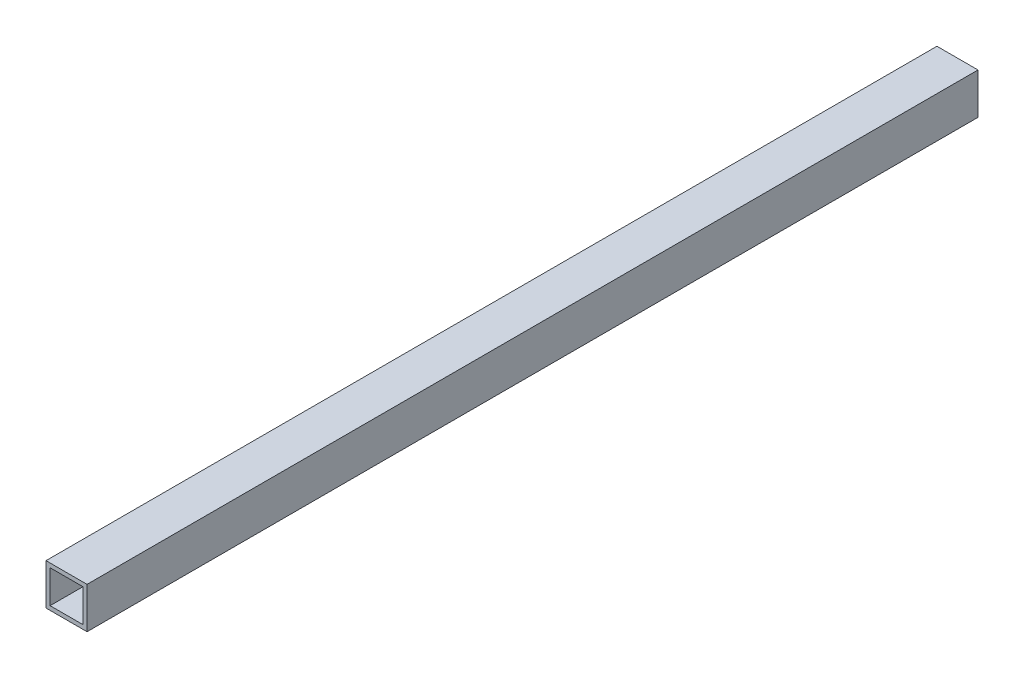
ISO-10303-21;
HEADER;
FILE_DESCRIPTION(('STEP AP214'),'2;1');
FILE_NAME('part.step','',(''),(''),'','','');
FILE_SCHEMA(('AUTOMOTIVE_DESIGN { 1 0 10303 214 1 1 1 1 }'));
ENDSEC;
DATA;
#1=APPLICATION_CONTEXT('core data for automotive mechanical design processes');
#2=APPLICATION_PROTOCOL_DEFINITION('international standard','automotive_design',2000,#1);
#3=PRODUCT_CONTEXT('',#1,'mechanical');
#4=PRODUCT('Part','Part','',(#3));
#5=PRODUCT_RELATED_PRODUCT_CATEGORY('part','',(#4));
#6=PRODUCT_DEFINITION_FORMATION('','',#4);
#7=PRODUCT_DEFINITION_CONTEXT('part definition',#1,'design');
#8=PRODUCT_DEFINITION('design','',#6,#7);
#9=PRODUCT_DEFINITION_SHAPE('','',#8);
#10=(LENGTH_UNIT() NAMED_UNIT(*) SI_UNIT(.MILLI.,.METRE.));
#11=(NAMED_UNIT(*) PLANE_ANGLE_UNIT() SI_UNIT($,.RADIAN.));
#12=(NAMED_UNIT(*) SI_UNIT($,.STERADIAN.) SOLID_ANGLE_UNIT());
#13=UNCERTAINTY_MEASURE_WITH_UNIT(LENGTH_MEASURE(1.E-05),#10,'distance_accuracy_value','');
#14=(GEOMETRIC_REPRESENTATION_CONTEXT(3) GLOBAL_UNCERTAINTY_ASSIGNED_CONTEXT((#13)) GLOBAL_UNIT_ASSIGNED_CONTEXT((#10,
#11,#12)) REPRESENTATION_CONTEXT('',''));
#15=CARTESIAN_POINT('',(0.,0.,0.));
#16=DIRECTION('',(0.,0.,1.));
#17=DIRECTION('',(1.,0.,0.));
#18=AXIS2_PLACEMENT_3D('',#15,#16,#17);
#19=CARTESIAN_POINT('',(0.,0.,217.));
#20=DIRECTION('',(0.,0.,1.));
#21=DIRECTION('',(1.,0.,0.));
#22=AXIS2_PLACEMENT_3D('',#19,#20,#21);
#23=PLANE('',#22);
#24=DIRECTION('',(0.,-1.,0.));
#25=VECTOR('',#24,1.);
#26=CARTESIAN_POINT('',(-4.91938651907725,6.2171488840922,217.));
#27=LINE('',#26,#25);
#28=CARTESIAN_POINT('',(-4.91938651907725,6.2171488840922,217.));
#29=VERTEX_POINT('',#28);
#30=CARTESIAN_POINT('',(-4.91938651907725,-3.78285111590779,217.));
#31=VERTEX_POINT('',#30);
#32=EDGE_CURVE('E135',#29,#31,#27,.T.);
#33=ORIENTED_EDGE('',*,*,#32,.T.);
#34=DIRECTION('',(1.,0.,0.));
#35=VECTOR('',#34,1.);
#36=CARTESIAN_POINT('',(-4.91938651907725,-3.78285111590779,217.));
#37=LINE('',#36,#35);
#38=CARTESIAN_POINT('',(5.08061348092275,-3.78285111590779,217.));
#39=VERTEX_POINT('',#38);
#40=EDGE_CURVE('E138',#31,#39,#37,.T.);
#41=ORIENTED_EDGE('',*,*,#40,.T.);
#42=DIRECTION('',(0.,1.,0.));
#43=VECTOR('',#42,1.);
#44=CARTESIAN_POINT('',(5.08061348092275,6.2171488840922,217.));
#45=LINE('',#44,#43);
#46=CARTESIAN_POINT('',(5.08061348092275,6.2171488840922,217.));
#47=VERTEX_POINT('',#46);
#48=EDGE_CURVE('E141',#39,#47,#45,.T.);
#49=ORIENTED_EDGE('',*,*,#48,.T.);
#50=DIRECTION('',(-1.,0.,0.));
#51=VECTOR('',#50,1.);
#52=CARTESIAN_POINT('',(-4.91938651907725,6.2171488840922,217.));
#53=LINE('',#52,#51);
#54=EDGE_CURVE('E143',#47,#29,#53,.T.);
#55=ORIENTED_EDGE('',*,*,#54,.T.);
#56=EDGE_LOOP('',(#33,#41,#49,#55));
#57=FACE_BOUND('',#56,.T.);
#58=DIRECTION('',(1.,0.,0.));
#59=VECTOR('',#58,1.);
#60=CARTESIAN_POINT('',(4.08061348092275,-2.7828511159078,217.));
#61=LINE('',#60,#59);
#62=CARTESIAN_POINT('',(-3.91938651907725,-2.7828511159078,217.));
#63=VERTEX_POINT('',#62);
#64=CARTESIAN_POINT('',(4.08061348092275,-2.7828511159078,217.));
#65=VERTEX_POINT('',#64);
#66=EDGE_CURVE('E107',#63,#65,#61,.T.);
#67=ORIENTED_EDGE('',*,*,#66,.F.);
#68=DIRECTION('',(0.,-1.,0.));
#69=VECTOR('',#68,1.);
#70=CARTESIAN_POINT('',(-3.91938651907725,-2.7828511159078,217.));
#71=LINE('',#70,#69);
#72=CARTESIAN_POINT('',(-3.91938651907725,5.2171488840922,217.));
#73=VERTEX_POINT('',#72);
#74=EDGE_CURVE('E99',#73,#63,#71,.T.);
#75=ORIENTED_EDGE('',*,*,#74,.F.);
#76=DIRECTION('',(-1.,0.,0.));
#77=VECTOR('',#76,1.);
#78=CARTESIAN_POINT('',(4.08061348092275,5.2171488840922,217.));
#79=LINE('',#78,#77);
#80=CARTESIAN_POINT('',(4.08061348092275,5.2171488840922,217.));
#81=VERTEX_POINT('',#80);
#82=EDGE_CURVE('E121',#81,#73,#79,.T.);
#83=ORIENTED_EDGE('',*,*,#82,.F.);
#84=DIRECTION('',(0.,1.,0.));
#85=VECTOR('',#84,1.);
#86=CARTESIAN_POINT('',(4.08061348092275,-2.7828511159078,217.));
#87=LINE('',#86,#85);
#88=EDGE_CURVE('E119',#65,#81,#87,.T.);
#89=ORIENTED_EDGE('',*,*,#88,.F.);
#90=EDGE_LOOP('',(#67,#75,#83,#89));
#91=FACE_BOUND('',#90,.T.);
#92=ADVANCED_FACE('F34',(#57,#91),#23,.T.);
#93=CARTESIAN_POINT('',(0.,0.,0.));
#94=DIRECTION('',(0.,0.,1.));
#95=DIRECTION('',(1.,0.,0.));
#96=AXIS2_PLACEMENT_3D('',#93,#94,#95);
#97=PLANE('',#96);
#98=DIRECTION('',(0.,-1.,0.));
#99=VECTOR('',#98,1.);
#100=CARTESIAN_POINT('',(-4.91938651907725,6.2171488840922,0.));
#101=LINE('',#100,#99);
#102=CARTESIAN_POINT('',(-4.91938651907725,6.2171488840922,0.));
#103=VERTEX_POINT('',#102);
#104=CARTESIAN_POINT('',(-4.91938651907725,-3.78285111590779,0.));
#105=VERTEX_POINT('',#104);
#106=EDGE_CURVE('E115',#103,#105,#101,.T.);
#107=ORIENTED_EDGE('',*,*,#106,.F.);
#108=DIRECTION('',(-1.,0.,0.));
#109=VECTOR('',#108,1.);
#110=CARTESIAN_POINT('',(-4.91938651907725,6.2171488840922,0.));
#111=LINE('',#110,#109);
#112=CARTESIAN_POINT('',(5.08061348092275,6.2171488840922,0.));
#113=VERTEX_POINT('',#112);
#114=EDGE_CURVE('E139',#113,#103,#111,.T.);
#115=ORIENTED_EDGE('',*,*,#114,.F.);
#116=DIRECTION('',(0.,1.,0.));
#117=VECTOR('',#116,1.);
#118=CARTESIAN_POINT('',(5.08061348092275,6.2171488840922,0.));
#119=LINE('',#118,#117);
#120=CARTESIAN_POINT('',(5.08061348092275,-3.78285111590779,0.));
#121=VERTEX_POINT('',#120);
#122=EDGE_CURVE('E150',#121,#113,#119,.T.);
#123=ORIENTED_EDGE('',*,*,#122,.F.);
#124=DIRECTION('',(1.,0.,0.));
#125=VECTOR('',#124,1.);
#126=CARTESIAN_POINT('',(-4.91938651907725,-3.78285111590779,0.));
#127=LINE('',#126,#125);
#128=EDGE_CURVE('E148',#105,#121,#127,.T.);
#129=ORIENTED_EDGE('',*,*,#128,.F.);
#130=EDGE_LOOP('',(#107,#115,#123,#129));
#131=FACE_BOUND('',#130,.T.);
#132=DIRECTION('',(0.,-1.,0.));
#133=VECTOR('',#132,1.);
#134=CARTESIAN_POINT('',(-3.91938651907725,-2.7828511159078,0.));
#135=LINE('',#134,#133);
#136=CARTESIAN_POINT('',(-3.91938651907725,5.2171488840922,0.));
#137=VERTEX_POINT('',#136);
#138=CARTESIAN_POINT('',(-3.91938651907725,-2.7828511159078,0.));
#139=VERTEX_POINT('',#138);
#140=EDGE_CURVE('E57',#137,#139,#135,.T.);
#141=ORIENTED_EDGE('',*,*,#140,.T.);
#142=DIRECTION('',(1.,0.,0.));
#143=VECTOR('',#142,1.);
#144=CARTESIAN_POINT('',(4.08061348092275,-2.7828511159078,0.));
#145=LINE('',#144,#143);
#146=CARTESIAN_POINT('',(4.08061348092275,-2.7828511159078,0.));
#147=VERTEX_POINT('',#146);
#148=EDGE_CURVE('E114',#139,#147,#145,.T.);
#149=ORIENTED_EDGE('',*,*,#148,.T.);
#150=DIRECTION('',(0.,1.,0.));
#151=VECTOR('',#150,1.);
#152=CARTESIAN_POINT('',(4.08061348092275,-2.7828511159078,0.));
#153=LINE('',#152,#151);
#154=CARTESIAN_POINT('',(4.08061348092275,5.2171488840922,0.));
#155=VERTEX_POINT('',#154);
#156=EDGE_CURVE('E127',#147,#155,#153,.T.);
#157=ORIENTED_EDGE('',*,*,#156,.T.);
#158=DIRECTION('',(-1.,0.,0.));
#159=VECTOR('',#158,1.);
#160=CARTESIAN_POINT('',(4.08061348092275,5.2171488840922,0.));
#161=LINE('',#160,#159);
#162=EDGE_CURVE('E108',#155,#137,#161,.T.);
#163=ORIENTED_EDGE('',*,*,#162,.T.);
#164=EDGE_LOOP('',(#141,#149,#157,#163));
#165=FACE_BOUND('',#164,.T.);
#166=ADVANCED_FACE('F168',(#131,#165),#97,.F.);
#167=CARTESIAN_POINT('',(-4.91938651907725,6.2171488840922,217.));
#168=DIRECTION('',(1.,0.,0.));
#169=DIRECTION('',(0.,1.,0.));
#170=AXIS2_PLACEMENT_3D('',#167,#168,#169);
#171=PLANE('',#170);
#172=ORIENTED_EDGE('',*,*,#106,.T.);
#173=DIRECTION('',(0.,0.,-1.));
#174=VECTOR('',#173,1.);
#175=CARTESIAN_POINT('',(-4.91938651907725,-3.78285111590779,217.));
#176=LINE('',#175,#174);
#177=EDGE_CURVE('E11',#31,#105,#176,.T.);
#178=ORIENTED_EDGE('',*,*,#177,.F.);
#179=ORIENTED_EDGE('',*,*,#32,.F.);
#180=DIRECTION('',(0.,0.,-1.));
#181=VECTOR('',#180,1.);
#182=CARTESIAN_POINT('',(-4.91938651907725,6.2171488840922,217.));
#183=LINE('',#182,#181);
#184=EDGE_CURVE('E145',#29,#103,#183,.T.);
#185=ORIENTED_EDGE('',*,*,#184,.T.);
#186=EDGE_LOOP('',(#172,#178,#179,#185));
#187=FACE_BOUND('',#186,.T.);
#188=ADVANCED_FACE('F36',(#187),#171,.F.);
#189=CARTESIAN_POINT('',(-4.91938651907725,-3.78285111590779,217.));
#190=DIRECTION('',(0.,1.,0.));
#191=DIRECTION('',(0.,0.,1.));
#192=AXIS2_PLACEMENT_3D('',#189,#190,#191);
#193=PLANE('',#192);
#194=ORIENTED_EDGE('',*,*,#128,.T.);
#195=DIRECTION('',(0.,0.,-1.));
#196=VECTOR('',#195,1.);
#197=CARTESIAN_POINT('',(5.08061348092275,-3.78285111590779,217.));
#198=LINE('',#197,#196);
#199=EDGE_CURVE('E42',#39,#121,#198,.T.);
#200=ORIENTED_EDGE('',*,*,#199,.F.);
#201=ORIENTED_EDGE('',*,*,#40,.F.);
#202=ORIENTED_EDGE('',*,*,#177,.T.);
#203=EDGE_LOOP('',(#194,#200,#201,#202));
#204=FACE_BOUND('',#203,.T.);
#205=ADVANCED_FACE('F178',(#204),#193,.F.);
#206=CARTESIAN_POINT('',(5.08061348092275,6.2171488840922,217.));
#207=DIRECTION('',(-1.,0.,0.));
#208=DIRECTION('',(0.,-1.,0.));
#209=AXIS2_PLACEMENT_3D('',#206,#207,#208);
#210=PLANE('',#209);
#211=ORIENTED_EDGE('',*,*,#122,.T.);
#212=DIRECTION('',(0.,0.,-1.));
#213=VECTOR('',#212,1.);
#214=CARTESIAN_POINT('',(5.08061348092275,6.2171488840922,217.));
#215=LINE('',#214,#213);
#216=EDGE_CURVE('E155',#47,#113,#215,.T.);
#217=ORIENTED_EDGE('',*,*,#216,.F.);
#218=ORIENTED_EDGE('',*,*,#48,.F.);
#219=ORIENTED_EDGE('',*,*,#199,.T.);
#220=EDGE_LOOP('',(#211,#217,#218,#219));
#221=FACE_BOUND('',#220,.T.);
#222=ADVANCED_FACE('F162',(#221),#210,.F.);
#223=CARTESIAN_POINT('',(-4.91938651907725,6.2171488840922,217.));
#224=DIRECTION('',(0.,-1.,0.));
#225=DIRECTION('',(0.,0.,-1.));
#226=AXIS2_PLACEMENT_3D('',#223,#224,#225);
#227=PLANE('',#226);
#228=ORIENTED_EDGE('',*,*,#114,.T.);
#229=ORIENTED_EDGE('',*,*,#184,.F.);
#230=ORIENTED_EDGE('',*,*,#54,.F.);
#231=ORIENTED_EDGE('',*,*,#216,.T.);
#232=EDGE_LOOP('',(#228,#229,#230,#231));
#233=FACE_BOUND('',#232,.T.);
#234=ADVANCED_FACE('F172',(#233),#227,.F.);
#235=CARTESIAN_POINT('',(-3.91938651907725,-2.7828511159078,217.));
#236=DIRECTION('',(1.,0.,0.));
#237=DIRECTION('',(0.,0.,-1.));
#238=AXIS2_PLACEMENT_3D('',#235,#236,#237);
#239=PLANE('',#238);
#240=ORIENTED_EDGE('',*,*,#140,.F.);
#241=DIRECTION('',(0.,0.,-1.));
#242=VECTOR('',#241,1.);
#243=CARTESIAN_POINT('',(-3.91938651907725,5.2171488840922,217.));
#244=LINE('',#243,#242);
#245=EDGE_CURVE('E103',#73,#137,#244,.T.);
#246=ORIENTED_EDGE('',*,*,#245,.F.);
#247=ORIENTED_EDGE('',*,*,#74,.T.);
#248=DIRECTION('',(0.,0.,-1.));
#249=VECTOR('',#248,1.);
#250=CARTESIAN_POINT('',(-3.91938651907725,-2.7828511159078,217.));
#251=LINE('',#250,#249);
#252=EDGE_CURVE('E102',#63,#139,#251,.T.);
#253=ORIENTED_EDGE('',*,*,#252,.T.);
#254=EDGE_LOOP('',(#240,#246,#247,#253));
#255=FACE_BOUND('',#254,.T.);
#256=ADVANCED_FACE('F101',(#255),#239,.T.);
#257=CARTESIAN_POINT('',(4.08061348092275,-2.7828511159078,217.));
#258=DIRECTION('',(0.,1.,0.));
#259=DIRECTION('',(0.,0.,1.));
#260=AXIS2_PLACEMENT_3D('',#257,#258,#259);
#261=PLANE('',#260);
#262=ORIENTED_EDGE('',*,*,#148,.F.);
#263=ORIENTED_EDGE('',*,*,#252,.F.);
#264=ORIENTED_EDGE('',*,*,#66,.T.);
#265=DIRECTION('',(0.,0.,-1.));
#266=VECTOR('',#265,1.);
#267=CARTESIAN_POINT('',(4.08061348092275,-2.7828511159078,217.));
#268=LINE('',#267,#266);
#269=EDGE_CURVE('E116',#65,#147,#268,.T.);
#270=ORIENTED_EDGE('',*,*,#269,.T.);
#271=EDGE_LOOP('',(#262,#263,#264,#270));
#272=FACE_BOUND('',#271,.T.);
#273=ADVANCED_FACE('F111',(#272),#261,.T.);
#274=CARTESIAN_POINT('',(4.08061348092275,-2.7828511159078,217.));
#275=DIRECTION('',(-1.,0.,0.));
#276=DIRECTION('',(0.,0.,1.));
#277=AXIS2_PLACEMENT_3D('',#274,#275,#276);
#278=PLANE('',#277);
#279=ORIENTED_EDGE('',*,*,#156,.F.);
#280=ORIENTED_EDGE('',*,*,#269,.F.);
#281=ORIENTED_EDGE('',*,*,#88,.T.);
#282=DIRECTION('',(0.,0.,-1.));
#283=VECTOR('',#282,1.);
#284=CARTESIAN_POINT('',(4.08061348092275,5.2171488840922,217.));
#285=LINE('',#284,#283);
#286=EDGE_CURVE('E49',#81,#155,#285,.T.);
#287=ORIENTED_EDGE('',*,*,#286,.T.);
#288=EDGE_LOOP('',(#279,#280,#281,#287));
#289=FACE_BOUND('',#288,.T.);
#290=ADVANCED_FACE('F201',(#289),#278,.T.);
#291=CARTESIAN_POINT('',(4.08061348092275,5.2171488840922,217.));
#292=DIRECTION('',(0.,-1.,0.));
#293=DIRECTION('',(0.,0.,-1.));
#294=AXIS2_PLACEMENT_3D('',#291,#292,#293);
#295=PLANE('',#294);
#296=ORIENTED_EDGE('',*,*,#162,.F.);
#297=ORIENTED_EDGE('',*,*,#286,.F.);
#298=ORIENTED_EDGE('',*,*,#82,.T.);
#299=ORIENTED_EDGE('',*,*,#245,.T.);
#300=EDGE_LOOP('',(#296,#297,#298,#299));
#301=FACE_BOUND('',#300,.T.);
#302=ADVANCED_FACE('F205',(#301),#295,.T.);
#303=CLOSED_SHELL('',(#92,#166,#188,#205,#222,#234,#256,#273,#290,#302));
#304=MANIFOLD_SOLID_BREP('B2',#303);
#305=ADVANCED_BREP_SHAPE_REPRESENTATION('',(#18,#304),#14);
#306=SHAPE_DEFINITION_REPRESENTATION(#9,#305);
ENDSEC;
END-ISO-10303-21;
